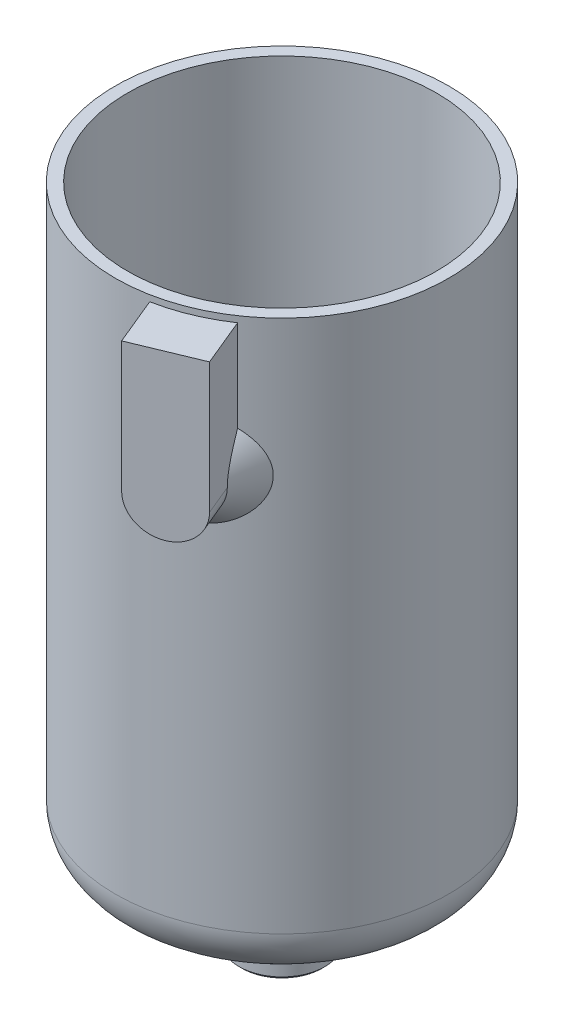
ISO-10303-21;
HEADER;
FILE_DESCRIPTION(('STEP AP214'),'2;1');
FILE_NAME('part.step','',(''),(''),'','','');
FILE_SCHEMA(('AUTOMOTIVE_DESIGN { 1 0 10303 214 1 1 1 1 }'));
ENDSEC;
DATA;
#1=APPLICATION_CONTEXT('core data for automotive mechanical design processes');
#2=APPLICATION_PROTOCOL_DEFINITION('international standard','automotive_design',2000,#1);
#3=PRODUCT_CONTEXT('',#1,'mechanical');
#4=PRODUCT('Part','Part','',(#3));
#5=PRODUCT_RELATED_PRODUCT_CATEGORY('part','',(#4));
#6=PRODUCT_DEFINITION_FORMATION('','',#4);
#7=PRODUCT_DEFINITION_CONTEXT('part definition',#1,'design');
#8=PRODUCT_DEFINITION('design','',#6,#7);
#9=PRODUCT_DEFINITION_SHAPE('','',#8);
#10=(LENGTH_UNIT() NAMED_UNIT(*) SI_UNIT(.MILLI.,.METRE.));
#11=(NAMED_UNIT(*) PLANE_ANGLE_UNIT() SI_UNIT($,.RADIAN.));
#12=(NAMED_UNIT(*) SI_UNIT($,.STERADIAN.) SOLID_ANGLE_UNIT());
#13=UNCERTAINTY_MEASURE_WITH_UNIT(LENGTH_MEASURE(1.E-05),#10,'distance_accuracy_value','');
#14=(GEOMETRIC_REPRESENTATION_CONTEXT(3) GLOBAL_UNCERTAINTY_ASSIGNED_CONTEXT((#13)) GLOBAL_UNIT_ASSIGNED_CONTEXT((#10,
#11,#12)) REPRESENTATION_CONTEXT('',''));
#15=CARTESIAN_POINT('',(0.,0.,0.));
#16=DIRECTION('',(0.,0.,1.));
#17=DIRECTION('',(1.,0.,0.));
#18=AXIS2_PLACEMENT_3D('',#15,#16,#17);
#19=CARTESIAN_POINT('',(0.,0.,0.));
#20=DIRECTION('',(0.,-1.,0.));
#21=DIRECTION('',(0.,0.,-1.));
#22=AXIS2_PLACEMENT_3D('',#19,#20,#21);
#23=CYLINDRICAL_SURFACE('',#22,27.25);
#24=CARTESIAN_POINT('',(0.,0.,0.));
#25=DIRECTION('',(0.,-1.,0.));
#26=DIRECTION('',(0.,0.,-1.));
#27=AXIS2_PLACEMENT_3D('',#24,#25,#26);
#28=CIRCLE('',#27,27.25);
#29=CARTESIAN_POINT('',(0.,0.,-27.25));
#30=VERTEX_POINT('',#29);
#31=EDGE_CURVE('E146',#30,#30,#28,.T.);
#32=ORIENTED_EDGE('',*,*,#31,.T.);
#33=EDGE_LOOP('',(#32));
#34=FACE_BOUND('',#33,.T.);
#35=CARTESIAN_POINT('',(0.,-87.2,0.));
#36=DIRECTION('',(0.,-1.,0.));
#37=DIRECTION('',(0.,0.,-1.));
#38=AXIS2_PLACEMENT_3D('',#35,#36,#37);
#39=CIRCLE('',#38,27.25);
#40=CARTESIAN_POINT('',(0.,-87.2,-27.25));
#41=VERTEX_POINT('',#40);
#42=EDGE_CURVE('E149',#41,#41,#39,.T.);
#43=ORIENTED_EDGE('',*,*,#42,.F.);
#44=EDGE_LOOP('',(#43));
#45=FACE_BOUND('',#44,.T.);
#46=DIRECTION('',(0.,-1.,0.));
#47=VECTOR('',#46,1.);
#48=CARTESIAN_POINT('',(5.13217080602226,0.,26.7623489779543));
#49=LINE('',#48,#47);
#50=CARTESIAN_POINT('',(5.13217080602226,-1.,26.7623489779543));
#51=VERTEX_POINT('',#50);
#52=CARTESIAN_POINT('',(5.13217080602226,-15.9293145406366,26.7623489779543));
#53=VERTEX_POINT('',#52);
#54=EDGE_CURVE('E52',#51,#53,#49,.T.);
#55=ORIENTED_EDGE('',*,*,#54,.F.);
#56=CARTESIAN_POINT('',(0.,-1.,0.));
#57=DIRECTION('',(0.,-1.,0.));
#58=DIRECTION('',(0.,0.,-1.));
#59=AXIS2_PLACEMENT_3D('',#56,#57,#58);
#60=CIRCLE('',#59,27.25);
#61=CARTESIAN_POINT('',(15.2948456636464,-1.,22.5528312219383));
#62=VERTEX_POINT('',#61);
#63=EDGE_CURVE('E11',#62,#51,#60,.T.);
#64=ORIENTED_EDGE('',*,*,#63,.F.);
#65=DIRECTION('',(0.,-1.,0.));
#66=VECTOR('',#65,1.);
#67=CARTESIAN_POINT('',(15.2948456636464,0.,22.5528312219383));
#68=LINE('',#67,#66);
#69=CARTESIAN_POINT('',(15.2948456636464,-15.9293145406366,22.5528312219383));
#70=VERTEX_POINT('',#69);
#71=EDGE_CURVE('E107',#70,#62,#68,.F.);
#72=ORIENTED_EDGE('',*,*,#71,.F.);
#73=CARTESIAN_POINT('',(3.39021248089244,-27.3423893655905,27.0382869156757));
#74=CARTESIAN_POINT('',(3.58895261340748,-27.53196795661,27.0133671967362));
#75=CARTESIAN_POINT('',(3.79571275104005,-27.712737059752,26.9852110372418));
#76=CARTESIAN_POINT('',(4.22272311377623,-28.0563612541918,26.9216965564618));
#77=CARTESIAN_POINT('',(4.44298101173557,-28.2192060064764,26.8863341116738));
#78=CARTESIAN_POINT('',(4.89513629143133,-28.52687842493,26.807702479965));
#79=CARTESIAN_POINT('',(5.12705897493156,-28.6716643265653,26.7644155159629));
#80=CARTESIAN_POINT('',(5.60001691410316,-28.9423832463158,26.6694673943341));
#81=CARTESIAN_POINT('',(5.8410525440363,-29.0683154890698,26.6178058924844));
#82=CARTESIAN_POINT('',(6.33176683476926,-29.3015675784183,26.5053761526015));
#83=CARTESIAN_POINT('',(6.58148878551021,-29.4087708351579,26.4445549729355));
#84=CARTESIAN_POINT('',(7.08628998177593,-29.6031445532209,26.3137791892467));
#85=CARTESIAN_POINT('',(7.34136937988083,-29.6903144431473,26.2438243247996));
#86=CARTESIAN_POINT('',(7.85477618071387,-29.8440752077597,26.094757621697));
#87=CARTESIAN_POINT('',(8.11310058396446,-29.91068381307,26.0156537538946));
#88=CARTESIAN_POINT('',(8.63134056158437,-30.0230071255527,25.8483384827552));
#89=CARTESIAN_POINT('',(8.89125614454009,-30.0687217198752,25.7601270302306));
#90=CARTESIAN_POINT('',(9.41921029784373,-30.1400743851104,25.5718990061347));
#91=CARTESIAN_POINT('',(9.68724021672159,-30.1650166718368,25.4715932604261));
#92=CARTESIAN_POINT('',(10.2209959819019,-30.1921021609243,25.2621443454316));
#93=CARTESIAN_POINT('',(10.4867217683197,-30.1942447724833,25.1530009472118));
#94=CARTESIAN_POINT('',(11.0139427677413,-30.1757119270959,24.9266498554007));
#95=CARTESIAN_POINT('',(11.2754375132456,-30.1550339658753,24.8094412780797));
#96=CARTESIAN_POINT('',(11.7923185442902,-30.0910190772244,24.5679688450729));
#97=CARTESIAN_POINT('',(12.0477049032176,-30.0476824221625,24.4437050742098));
#98=CARTESIAN_POINT('',(12.5474217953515,-29.9393774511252,24.1909508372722));
#99=CARTESIAN_POINT('',(12.7918523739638,-29.8746950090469,24.0625354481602));
#100=CARTESIAN_POINT('',(13.2716072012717,-29.7239955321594,23.8012930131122));
#101=CARTESIAN_POINT('',(13.5069314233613,-29.6379784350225,23.6684659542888));
#102=CARTESIAN_POINT('',(13.9672875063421,-29.4450355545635,23.3997536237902));
#103=CARTESIAN_POINT('',(14.1923116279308,-29.338094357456,23.2638661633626));
#104=CARTESIAN_POINT('',(14.6306370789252,-29.1038631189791,22.9907295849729));
#105=CARTESIAN_POINT('',(14.8439384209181,-28.9765730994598,22.8534804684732));
#106=CARTESIAN_POINT('',(15.261009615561,-28.6999029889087,22.5771492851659));
#107=CARTESIAN_POINT('',(15.4645681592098,-28.550197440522,22.4380736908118));
#108=CARTESIAN_POINT('',(15.8571145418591,-28.230752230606,22.1623993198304));
#109=CARTESIAN_POINT('',(16.0461032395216,-28.0610137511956,22.025800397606));
#110=CARTESIAN_POINT('',(16.4080576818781,-27.7020268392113,21.7575005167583));
#111=CARTESIAN_POINT('',(16.5810364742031,-27.5127945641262,21.6257956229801));
#112=CARTESIAN_POINT('',(16.9095211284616,-27.1152156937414,21.3699315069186));
#113=CARTESIAN_POINT('',(17.0650339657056,-26.9068767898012,21.2457692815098));
#114=CARTESIAN_POINT('',(17.4182638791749,-26.3798438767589,20.9580018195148));
#115=CARTESIAN_POINT('',(17.6062811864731,-26.0515466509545,20.799727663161));
#116=CARTESIAN_POINT('',(17.9366989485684,-25.3601194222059,20.5154821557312));
#117=CARTESIAN_POINT('',(18.0791772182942,-24.9970502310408,20.3894557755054));
#118=CARTESIAN_POINT('',(18.292024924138,-24.3034344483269,20.198550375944));
#119=CARTESIAN_POINT('',(18.3703468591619,-23.9771807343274,20.1270650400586));
#120=CARTESIAN_POINT('',(18.4851144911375,-23.3114724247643,20.0217203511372));
#121=CARTESIAN_POINT('',(18.5215915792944,-22.9720279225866,19.9878327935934));
#122=CARTESIAN_POINT('',(18.5501837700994,-22.2887178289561,19.9613032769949));
#123=CARTESIAN_POINT('',(18.5421825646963,-21.9448429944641,19.9687694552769));
#124=CARTESIAN_POINT('',(18.482148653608,-21.2643164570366,20.0243411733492));
#125=CARTESIAN_POINT('',(18.4300999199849,-20.9276674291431,20.0724615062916));
#126=CARTESIAN_POINT('',(18.2877559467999,-20.2811026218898,20.2022089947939));
#127=CARTESIAN_POINT('',(18.1987189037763,-19.9706785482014,20.2827313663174));
#128=CARTESIAN_POINT('',(17.9869501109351,-19.370256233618,20.4707636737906));
#129=CARTESIAN_POINT('',(17.8641959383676,-19.0802717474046,20.5782915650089));
#130=CARTESIAN_POINT('',(17.526813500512,-18.3974832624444,20.8672500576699));
#131=CARTESIAN_POINT('',(17.2957550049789,-18.0175968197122,21.060094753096));
#132=CARTESIAN_POINT('',(16.7816419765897,-17.3108982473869,21.4720227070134));
#133=CARTESIAN_POINT('',(16.4985033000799,-16.9841736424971,21.6911482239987));
#134=CARTESIAN_POINT('',(15.8832490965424,-16.3814404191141,22.145732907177));
#135=CARTESIAN_POINT('',(15.5504528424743,-16.1062807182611,22.3813901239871));
#136=CARTESIAN_POINT('',(14.8453985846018,-15.6150877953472,22.8551240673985));
#137=CARTESIAN_POINT('',(14.4731513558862,-15.3990384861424,23.0932001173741));
#138=CARTESIAN_POINT('',(13.8595644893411,-15.1067611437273,23.4636819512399));
#139=CARTESIAN_POINT('',(13.6291340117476,-15.009971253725,23.598355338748));
#140=CARTESIAN_POINT('',(13.1583744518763,-14.8375024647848,23.8640444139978));
#141=CARTESIAN_POINT('',(12.9180444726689,-14.7618254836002,23.9950597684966));
#142=CARTESIAN_POINT('',(12.4289190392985,-14.6320780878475,24.2520276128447));
#143=CARTESIAN_POINT('',(12.1801213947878,-14.5780133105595,24.3779787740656));
#144=CARTESIAN_POINT('',(11.6756895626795,-14.4918897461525,24.6235547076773));
#145=CARTESIAN_POINT('',(11.4200555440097,-14.4598304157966,24.7431796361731));
#146=CARTESIAN_POINT('',(10.901455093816,-14.4177803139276,24.9760336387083));
#147=CARTESIAN_POINT('',(10.6384446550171,-14.4079805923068,25.0891992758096));
#148=CARTESIAN_POINT('',(10.1090934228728,-14.411088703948,25.3071266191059));
#149=CARTESIAN_POINT('',(9.84275258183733,-14.4239968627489,25.4118882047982));
#150=CARTESIAN_POINT('',(9.30875605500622,-14.4724153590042,25.612318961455));
#151=CARTESIAN_POINT('',(9.04110057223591,-14.5079223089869,25.7079894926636));
#152=CARTESIAN_POINT('',(8.50645619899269,-14.6012654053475,25.8898132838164));
#153=CARTESIAN_POINT('',(8.23946730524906,-14.6591014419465,25.9759665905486));
#154=CARTESIAN_POINT('',(7.7105597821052,-14.7960844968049,26.1378189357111));
#155=CARTESIAN_POINT('',(7.44861717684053,-14.8750373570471,26.2136041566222));
#156=CARTESIAN_POINT('',(6.92937561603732,-15.0539977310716,26.3556199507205));
#157=CARTESIAN_POINT('',(6.6720766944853,-15.1540053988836,26.4218504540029));
#158=CARTESIAN_POINT('',(6.16387451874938,-15.3746673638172,26.5450104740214));
#159=CARTESIAN_POINT('',(5.91297786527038,-15.4953420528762,26.6019306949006));
#160=CARTESIAN_POINT('',(5.41990459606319,-15.7567595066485,26.7067531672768));
#161=CARTESIAN_POINT('',(5.17772793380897,-15.8975021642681,26.7546554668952));
#162=CARTESIAN_POINT('',(4.70044423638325,-16.2010225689,26.8426553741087));
#163=CARTESIAN_POINT('',(4.46551376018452,-16.3641185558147,26.8826149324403));
#164=CARTESIAN_POINT('',(4.00940706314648,-16.7101168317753,26.9544143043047));
#165=CARTESIAN_POINT('',(3.78822952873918,-16.8930172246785,26.9862548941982));
#166=CARTESIAN_POINT('',(3.36272548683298,-17.2780043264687,27.0425692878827));
#167=CARTESIAN_POINT('',(3.15837608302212,-17.4800641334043,27.0670532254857));
#168=CARTESIAN_POINT('',(2.76964169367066,-17.9030098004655,27.1095893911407));
#169=CARTESIAN_POINT('',(2.5852468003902,-18.1238862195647,27.127644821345));
#170=CARTESIAN_POINT('',(2.18012149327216,-18.6640131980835,27.1636511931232));
#171=CARTESIAN_POINT('',(1.96903151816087,-18.9907764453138,27.1793854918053));
#172=CARTESIAN_POINT('',(1.60164588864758,-19.6742305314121,27.2035186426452));
#173=CARTESIAN_POINT('',(1.44528696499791,-20.0308862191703,27.2119259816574));
#174=CARTESIAN_POINT('',(1.26034920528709,-20.5843484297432,27.2209076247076));
#175=CARTESIAN_POINT('',(1.20681656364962,-20.7729947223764,27.2232995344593));
#176=CARTESIAN_POINT('',(1.11814216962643,-21.1545338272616,27.2270867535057));
#177=CARTESIAN_POINT('',(1.08299080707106,-21.3474243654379,27.2284825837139));
#178=CARTESIAN_POINT('',(1.03209314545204,-21.735659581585,27.2304599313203));
#179=CARTESIAN_POINT('',(1.01633588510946,-21.9310028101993,27.2310419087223));
#180=CARTESIAN_POINT('',(1.00462925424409,-22.3222166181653,27.2314745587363));
#181=CARTESIAN_POINT('',(1.00867729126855,-22.5180871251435,27.2313253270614));
#182=CARTESIAN_POINT('',(1.04649052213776,-23.0475326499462,27.229914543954));
#183=CARTESIAN_POINT('',(1.09935321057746,-23.379910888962,27.2279370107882));
#184=CARTESIAN_POINT('',(1.25871813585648,-24.0313363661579,27.2210253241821));
#185=CARTESIAN_POINT('',(1.36525478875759,-24.3503749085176,27.2160892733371));
#186=CARTESIAN_POINT('',(1.6280697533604,-24.9773821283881,27.2016469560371));
#187=CARTESIAN_POINT('',(1.7856509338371,-25.2847949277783,27.192017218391));
#188=CARTESIAN_POINT('',(2.14083923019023,-25.8748248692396,27.1663554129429));
#189=CARTESIAN_POINT('',(2.33842736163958,-26.1574536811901,27.1503263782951));
#190=CARTESIAN_POINT('',(2.6809858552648,-26.5891390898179,27.1181052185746));
#191=CARTESIAN_POINT('',(2.81571589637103,-26.746689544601,27.1045026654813));
#192=CARTESIAN_POINT('',(3.0955204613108,-27.0519533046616,27.0739735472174));
#193=CARTESIAN_POINT('',(3.24059375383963,-27.1996677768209,27.0570473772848));
#194=CARTESIAN_POINT('',(3.39021248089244,-27.3423893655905,27.0382869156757));
#195=B_SPLINE_CURVE_WITH_KNOTS('',3,(#73,#74,#75,#76,#77,#78,#79,#80,#81,#82,#83,#84,#85,#86,
#87,#88,#89,#90,#91,#92,#93,#94,#95,#96,#97,#98,#99,#100,#101,#102,#103,#104,#105,#106,#107,
#108,#109,#110,#111,#112,#113,#114,#115,#116,#117,#118,#119,#120,#121,#122,#123,#124,#125,#126,
#127,#128,#129,#130,#131,#132,#133,#134,#135,#136,#137,#138,#139,#140,#141,#142,#143,#144,#145,
#146,#147,#148,#149,#150,#151,#152,#153,#154,#155,#156,#157,#158,#159,#160,#161,#162,#163,#164,
#165,#166,#167,#168,#169,#170,#171,#172,#173,#174,#175,#176,#177,#178,#179,#180,#181,#182,#183,
#184,#185,#186,#187,#188,#189,#190,#191,#192,#193,#194),.UNSPECIFIED.,.T.,.F.,(4,2,2,2,2,2,2,2,
2,2,2,2,2,2,2,2,2,2,2,2,2,2,2,2,2,2,2,2,2,2,2,2,2,2,2,2,2,2,2,2,2,2,2,2,2,2,2,2,2,2,2,2,2,2,2,2,
2,2,2,2,4),(0.,0.827146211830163,1.65476706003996,2.48426778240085,3.31380260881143,
4.14833038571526,4.98288196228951,5.81671185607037,6.65054625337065,7.51129970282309,
8.37207545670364,9.23294567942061,10.0938055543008,10.9435749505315,11.7933468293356,
12.6437470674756,13.494146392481,14.358369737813,15.2225421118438,16.0860038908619,
16.9491195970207,18.1746763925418,19.3981276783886,20.4229041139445,21.4469112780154,
22.4735974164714,23.5006573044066,24.4953206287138,25.4906470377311,26.9367776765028,
28.3852656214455,29.8558314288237,31.3259966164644,32.1768697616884,33.0278201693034,
33.8789923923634,34.7301436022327,35.5885729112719,36.4470145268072,37.3053274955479,
38.1636362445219,39.0143095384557,39.8649890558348,40.7165128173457,41.5680320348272,
42.4332586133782,43.298402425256,44.1623489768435,45.0258645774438,46.1894536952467,
47.3516932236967,47.9392502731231,48.5264998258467,49.1134173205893,49.7002579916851,
50.7047089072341,51.7098047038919,52.7428969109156,53.775500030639,54.3982794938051,
55.0209849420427),.UNSPECIFIED.);
#196=EDGE_CURVE('E45',#53,#70,#195,.T.);
#197=ORIENTED_EDGE('',*,*,#196,.F.);
#198=EDGE_LOOP('',(#55,#64,#72,#197));
#199=FACE_BOUND('',#198,.T.);
#200=ADVANCED_FACE('F37',(#34,#45,#199),#23,.T.);
#201=CARTESIAN_POINT('',(9.56708580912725,-22.3,23.0969883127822));
#202=DIRECTION('',(-0.38268343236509,0.,-0.923879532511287));
#203=DIRECTION('',(-0.923879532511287,0.,0.38268343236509));
#204=AXIS2_PLACEMENT_3D('',#201,#202,#203);
#205=CONICAL_SURFACE('',#204,10.,0.753151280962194);
#206=CARTESIAN_POINT('',(4.55072172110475,-14.1396143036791,25.3586067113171));
#207=CARTESIAN_POINT('',(4.59839506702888,-14.2804658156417,25.4737003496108));
#208=CARTESIAN_POINT('',(4.64585664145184,-14.4218098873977,25.5882827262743));
#209=CARTESIAN_POINT('',(4.74028420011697,-14.7056354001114,25.8162510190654));
#210=CARTESIAN_POINT('',(4.78725016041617,-14.8481168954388,25.9296368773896));
#211=CARTESIAN_POINT('',(4.88066483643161,-15.1345245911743,26.1551598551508));
#212=CARTESIAN_POINT('',(4.92711287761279,-15.2784522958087,26.267295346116));
#213=CARTESIAN_POINT('',(5.01933981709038,-15.5677625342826,26.489950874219));
#214=CARTESIAN_POINT('',(5.0651187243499,-15.7131450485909,26.6004709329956));
#215=CARTESIAN_POINT('',(5.15746608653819,-16.010641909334,26.8234171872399));
#216=CARTESIAN_POINT('',(5.20400690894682,-16.1628149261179,26.9357766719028));
#217=CARTESIAN_POINT('',(5.29608963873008,-16.4692099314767,27.1580840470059));
#218=CARTESIAN_POINT('',(5.34163156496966,-16.6234318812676,27.2680319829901));
#219=CARTESIAN_POINT('',(5.43149918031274,-16.9341854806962,27.4849915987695));
#220=CARTESIAN_POINT('',(5.47582535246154,-17.0907161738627,27.5920044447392));
#221=CARTESIAN_POINT('',(5.56302222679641,-17.4065144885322,27.802516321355));
#222=CARTESIAN_POINT('',(5.60589300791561,-17.565781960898,27.9060155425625));
#223=CARTESIAN_POINT('',(5.69895588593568,-17.9223582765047,28.130689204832));
#224=CARTESIAN_POINT('',(5.74872156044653,-18.1204322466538,28.2508341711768));
#225=CARTESIAN_POINT('',(5.84485032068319,-18.5222228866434,28.4829095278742));
#226=CARTESIAN_POINT('',(5.89121293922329,-18.7259403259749,28.5948387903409));
#227=CARTESIAN_POINT('',(5.97883802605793,-19.1370769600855,28.8063844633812));
#228=CARTESIAN_POINT('',(6.02016258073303,-19.3444049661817,28.9061507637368));
#229=CARTESIAN_POINT('',(6.09705797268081,-19.7663041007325,29.0917926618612));
#230=CARTESIAN_POINT('',(6.13263004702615,-19.9808736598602,29.1776712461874));
#231=CARTESIAN_POINT('',(6.18861007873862,-20.3652278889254,29.3128189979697));
#232=CARTESIAN_POINT('',(6.2106091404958,-20.5334221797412,29.3659294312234));
#233=CARTESIAN_POINT('',(6.24933901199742,-20.8738542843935,29.4594316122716));
#234=CARTESIAN_POINT('',(6.26607398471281,-21.0460887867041,29.499833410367));
#235=CARTESIAN_POINT('',(6.28672511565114,-21.3086097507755,29.5496896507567));
#236=CARTESIAN_POINT('',(6.29290472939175,-21.3977046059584,29.5646085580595));
#237=CARTESIAN_POINT('',(6.30357992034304,-21.5765844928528,29.590380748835));
#238=CARTESIAN_POINT('',(6.30807558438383,-21.6663694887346,29.6012342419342));
#239=CARTESIAN_POINT('',(6.31531454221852,-21.8466902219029,29.6187106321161));
#240=CARTESIAN_POINT('',(6.31805262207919,-21.9372273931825,29.6253209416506));
#241=CARTESIAN_POINT('',(6.32171354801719,-22.1185744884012,29.634159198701));
#242=CARTESIAN_POINT('',(6.32263592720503,-22.209384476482,29.6363860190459));
#243=CARTESIAN_POINT('',(6.32262885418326,-22.3002,29.6363689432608));
#244=B_SPLINE_CURVE_WITH_KNOTS('',3,(#206,#207,#208,#209,#210,#211,#212,#213,#214,#215,#216,
#217,#218,#219,#220,#221,#222,#223,#224,#225,#226,#227,#228,#229,#230,#231,#232,#233,#234,#235,
#236,#237,#238,#239,#240,#241,#242,#243),.UNSPECIFIED.,.F.,.F.,(4,2,2,2,2,2,2,2,2,2,2,2,2,2,2,2,
2,2,4),(0.,0.564117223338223,1.12826157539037,1.69307053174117,2.25787191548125,
2.84225010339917,3.42661724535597,4.01074873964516,4.59484850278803,5.30551164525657,
6.01627216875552,6.71712475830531,7.41782642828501,7.95060623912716,8.48296364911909,
8.75451103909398,9.02604442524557,9.29837964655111,9.57078488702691),.UNSPECIFIED.);
#245=CARTESIAN_POINT('',(6.32262885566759,-22.3,29.6363689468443));
#246=VERTEX_POINT('',#245);
#247=EDGE_CURVE('E137',#53,#246,#244,.T.);
#248=ORIENTED_EDGE('',*,*,#247,.F.);
#249=ORIENTED_EDGE('',*,*,#196,.T.);
#250=CARTESIAN_POINT('',(16.4853037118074,-22.3002,25.4268511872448));
#251=CARTESIAN_POINT('',(16.4853061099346,-22.2304520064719,25.426856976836));
#252=CARTESIAN_POINT('',(16.4847639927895,-22.1607118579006,25.4255481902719));
#253=CARTESIAN_POINT('',(16.4826037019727,-22.0213519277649,25.4203327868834));
#254=CARTESIAN_POINT('',(16.4809856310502,-21.9517321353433,25.4164264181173));
#255=CARTESIAN_POINT('',(16.474543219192,-21.7433982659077,25.4008730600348));
#256=CARTESIAN_POINT('',(16.4681306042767,-21.605000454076,25.385391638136));
#257=CARTESIAN_POINT('',(16.4514607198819,-21.3321183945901,25.3451469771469));
#258=CARTESIAN_POINT('',(16.4412671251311,-21.1976070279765,25.3205374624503));
#259=CARTESIAN_POINT('',(16.4173821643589,-20.9306948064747,25.2628740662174));
#260=CARTESIAN_POINT('',(16.4036895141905,-20.7982947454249,25.2298170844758));
#261=CARTESIAN_POINT('',(16.361086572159,-20.4315867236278,25.1269644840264));
#262=CARTESIAN_POINT('',(16.3287355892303,-20.1999957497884,25.0488623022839));
#263=CARTESIAN_POINT('',(16.2563843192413,-19.7451184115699,24.8741908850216));
#264=CARTESIAN_POINT('',(16.2163770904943,-19.5218398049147,24.7776048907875));
#265=CARTESIAN_POINT('',(16.1299238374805,-19.079275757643,24.5688882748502));
#266=CARTESIAN_POINT('',(16.0833802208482,-18.8601220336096,24.4565220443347));
#267=CARTESIAN_POINT('',(15.985910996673,-18.4287514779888,24.2212105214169));
#268=CARTESIAN_POINT('',(15.934986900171,-18.2165322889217,24.0982688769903));
#269=CARTESIAN_POINT('',(15.8382886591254,-17.8315306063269,23.8648186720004));
#270=CARTESIAN_POINT('',(15.7930052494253,-17.6578994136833,23.7554948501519));
#271=CARTESIAN_POINT('',(15.7005661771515,-17.3140628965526,23.5323271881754));
#272=CARTESIAN_POINT('',(15.6534103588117,-17.1438578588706,23.4184829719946));
#273=CARTESIAN_POINT('',(15.5575602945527,-16.8062775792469,23.187080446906));
#274=CARTESIAN_POINT('',(15.5088651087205,-16.6389041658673,23.0695198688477));
#275=CARTESIAN_POINT('',(15.4102382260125,-16.3066622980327,22.8314135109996));
#276=CARTESIAN_POINT('',(15.3603064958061,-16.1417939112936,22.7108676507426));
#277=CARTESIAN_POINT('',(15.2616297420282,-15.821377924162,22.4726408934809));
#278=CARTESIAN_POINT('',(15.2129284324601,-15.665738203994,22.3550655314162));
#279=CARTESIAN_POINT('',(15.1147384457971,-15.3561615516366,22.1180139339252));
#280=CARTESIAN_POINT('',(15.0652497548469,-15.2022246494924,21.9985376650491));
#281=CARTESIAN_POINT('',(14.9656909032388,-14.8960968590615,21.7581813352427));
#282=CARTESIAN_POINT('',(14.9156218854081,-14.7439034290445,21.637304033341));
#283=CARTESIAN_POINT('',(14.8149142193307,-14.4408249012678,21.394174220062));
#284=CARTESIAN_POINT('',(14.764275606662,-14.2899397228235,21.2719217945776));
#285=CARTESIAN_POINT('',(14.7133965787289,-14.1396143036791,21.1490889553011));
#286=B_SPLINE_CURVE_WITH_KNOTS('',3,(#250,#251,#252,#253,#254,#255,#256,#257,#258,#259,#260,
#261,#262,#263,#264,#265,#266,#267,#268,#269,#270,#271,#272,#273,#274,#275,#276,#277,#278,#279,
#280,#281,#282,#283,#284,#285),.UNSPECIFIED.,.F.,.F.,(4,2,2,2,2,2,2,2,2,2,2,2,2,2,2,2,2,4),(0.,
0.209214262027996,0.418408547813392,0.836171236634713,1.24719623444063,1.65837229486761,
2.39663619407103,3.13557265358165,3.88702666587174,4.63822249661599,5.26848424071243,
5.89879852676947,6.52950540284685,7.16022929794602,7.7633471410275,8.36647560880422,
8.96856967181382,9.57062633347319),.UNSPECIFIED.);
#287=CARTESIAN_POINT('',(16.4853037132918,-22.3,25.4268511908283));
#288=VERTEX_POINT('',#287);
#289=EDGE_CURVE('E104',#288,#70,#286,.T.);
#290=ORIENTED_EDGE('',*,*,#289,.F.);
#291=CARTESIAN_POINT('',(11.4039662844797,-22.3,27.5316100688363));
#292=DIRECTION('',(0.38268343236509,0.,0.923879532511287));
#293=DIRECTION('',(0.923879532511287,0.,-0.38268343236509));
#294=AXIS2_PLACEMENT_3D('',#291,#292,#293);
#295=CIRCLE('',#294,5.50000000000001);
#296=EDGE_CURVE('E143',#246,#288,#295,.T.);
#297=ORIENTED_EDGE('',*,*,#296,.F.);
#298=EDGE_LOOP('',(#248,#249,#290,#297));
#299=FACE_BOUND('',#298,.T.);
#300=ADVANCED_FACE('F119',(#299),#205,.T.);
#301=CARTESIAN_POINT('',(0.,-92.1,0.));
#302=DIRECTION('',(0.,1.,0.));
#303=DIRECTION('',(0.,0.,1.));
#304=AXIS2_PLACEMENT_3D('',#301,#302,#303);
#305=PLANE('',#304);
#306=CARTESIAN_POINT('',(0.,-92.1,0.));
#307=DIRECTION('',(0.,-1.,0.));
#308=DIRECTION('',(0.,0.,-1.));
#309=AXIS2_PLACEMENT_3D('',#306,#307,#308);
#310=CIRCLE('',#309,5.);
#311=CARTESIAN_POINT('',(0.,-92.1,-5.));
#312=VERTEX_POINT('',#311);
#313=EDGE_CURVE('E191',#312,#312,#310,.T.);
#314=ORIENTED_EDGE('',*,*,#313,.T.);
#315=EDGE_LOOP('',(#314));
#316=FACE_BOUND('',#315,.T.);
#317=ADVANCED_FACE('F39',(#316),#305,.F.);
#318=CARTESIAN_POINT('',(0.,0.,0.));
#319=DIRECTION('',(0.,-1.,0.));
#320=DIRECTION('',(0.,0.,-1.));
#321=AXIS2_PLACEMENT_3D('',#318,#319,#320);
#322=CYLINDRICAL_SURFACE('',#321,5.);
#323=ORIENTED_EDGE('',*,*,#313,.F.);
#324=EDGE_LOOP('',(#323));
#325=FACE_BOUND('',#324,.T.);
#326=CARTESIAN_POINT('',(0.,-108.1,0.));
#327=DIRECTION('',(0.,-1.,0.));
#328=DIRECTION('',(0.,0.,-1.));
#329=AXIS2_PLACEMENT_3D('',#326,#327,#328);
#330=CIRCLE('',#329,5.);
#331=CARTESIAN_POINT('',(0.,-108.1,-5.));
#332=VERTEX_POINT('',#331);
#333=EDGE_CURVE('E188',#332,#332,#330,.T.);
#334=ORIENTED_EDGE('',*,*,#333,.T.);
#335=EDGE_LOOP('',(#334));
#336=FACE_BOUND('',#335,.T.);
#337=ADVANCED_FACE('F251',(#325,#336),#322,.F.);
#338=CARTESIAN_POINT('',(-5.,-108.1,0.));
#339=DIRECTION('',(0.,1.,0.));
#340=DIRECTION('',(0.,0.,1.));
#341=AXIS2_PLACEMENT_3D('',#338,#339,#340);
#342=PLANE('',#341);
#343=ORIENTED_EDGE('',*,*,#333,.F.);
#344=EDGE_LOOP('',(#343));
#345=FACE_BOUND('',#344,.T.);
#346=CARTESIAN_POINT('',(0.,-108.1,0.));
#347=DIRECTION('',(0.,-1.,0.));
#348=DIRECTION('',(0.,0.,-1.));
#349=AXIS2_PLACEMENT_3D('',#346,#347,#348);
#350=CIRCLE('',#349,6.5);
#351=CARTESIAN_POINT('',(0.,-108.1,-6.5));
#352=VERTEX_POINT('',#351);
#353=EDGE_CURVE('E185',#352,#352,#350,.T.);
#354=ORIENTED_EDGE('',*,*,#353,.T.);
#355=EDGE_LOOP('',(#354));
#356=FACE_BOUND('',#355,.T.);
#357=ADVANCED_FACE('F248',(#345,#356),#342,.F.);
#358=CARTESIAN_POINT('',(0.,-107.6,0.));
#359=DIRECTION('',(0.,1.,0.));
#360=DIRECTION('',(0.,0.,1.));
#361=AXIS2_PLACEMENT_3D('',#358,#359,#360);
#362=CONICAL_SURFACE('',#361,7.,0.785398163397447);
#363=ORIENTED_EDGE('',*,*,#353,.F.);
#364=EDGE_LOOP('',(#363));
#365=FACE_BOUND('',#364,.T.);
#366=CARTESIAN_POINT('',(0.,-107.6,0.));
#367=DIRECTION('',(0.,-1.,0.));
#368=DIRECTION('',(0.,0.,-1.));
#369=AXIS2_PLACEMENT_3D('',#366,#367,#368);
#370=CIRCLE('',#369,7.);
#371=CARTESIAN_POINT('',(0.,-107.6,-7.));
#372=VERTEX_POINT('',#371);
#373=EDGE_CURVE('E182',#372,#372,#370,.T.);
#374=ORIENTED_EDGE('',*,*,#373,.T.);
#375=EDGE_LOOP('',(#374));
#376=FACE_BOUND('',#375,.T.);
#377=ADVANCED_FACE('F244',(#365,#376),#362,.T.);
#378=CARTESIAN_POINT('',(0.,0.,0.));
#379=DIRECTION('',(0.,-1.,0.));
#380=DIRECTION('',(0.,0.,-1.));
#381=AXIS2_PLACEMENT_3D('',#378,#379,#380);
#382=CYLINDRICAL_SURFACE('',#381,7.);
#383=ORIENTED_EDGE('',*,*,#373,.F.);
#384=EDGE_LOOP('',(#383));
#385=FACE_BOUND('',#384,.T.);
#386=CARTESIAN_POINT('',(0.,-102.1,0.));
#387=DIRECTION('',(0.,-1.,0.));
#388=DIRECTION('',(0.,0.,-1.));
#389=AXIS2_PLACEMENT_3D('',#386,#387,#388);
#390=CIRCLE('',#389,7.);
#391=CARTESIAN_POINT('',(0.,-102.1,-7.));
#392=VERTEX_POINT('',#391);
#393=EDGE_CURVE('E179',#392,#392,#390,.T.);
#394=ORIENTED_EDGE('',*,*,#393,.T.);
#395=EDGE_LOOP('',(#394));
#396=FACE_BOUND('',#395,.T.);
#397=ADVANCED_FACE('F240',(#385,#396),#382,.T.);
#398=CARTESIAN_POINT('',(0.,-101.35,0.));
#399=DIRECTION('',(0.,1.,0.));
#400=DIRECTION('',(0.,0.,1.));
#401=AXIS2_PLACEMENT_3D('',#398,#399,#400);
#402=CONICAL_SURFACE('',#401,7.75,0.785398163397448);
#403=ORIENTED_EDGE('',*,*,#393,.F.);
#404=EDGE_LOOP('',(#403));
#405=FACE_BOUND('',#404,.T.);
#406=CARTESIAN_POINT('',(0.,-101.35,0.));
#407=DIRECTION('',(0.,-1.,0.));
#408=DIRECTION('',(0.,0.,-1.));
#409=AXIS2_PLACEMENT_3D('',#406,#407,#408);
#410=CIRCLE('',#409,7.75);
#411=CARTESIAN_POINT('',(0.,-101.35,-7.75));
#412=VERTEX_POINT('',#411);
#413=EDGE_CURVE('E176',#412,#412,#410,.T.);
#414=ORIENTED_EDGE('',*,*,#413,.T.);
#415=EDGE_LOOP('',(#414));
#416=FACE_BOUND('',#415,.T.);
#417=ADVANCED_FACE('F236',(#405,#416),#402,.T.);
#418=CARTESIAN_POINT('',(0.,0.,0.));
#419=DIRECTION('',(0.,-1.,0.));
#420=DIRECTION('',(0.,0.,-1.));
#421=AXIS2_PLACEMENT_3D('',#418,#419,#420);
#422=CYLINDRICAL_SURFACE('',#421,7.75);
#423=ORIENTED_EDGE('',*,*,#413,.F.);
#424=EDGE_LOOP('',(#423));
#425=FACE_BOUND('',#424,.T.);
#426=CARTESIAN_POINT('',(0.,-96.9,0.));
#427=DIRECTION('',(0.,-1.,0.));
#428=DIRECTION('',(0.,0.,-1.));
#429=AXIS2_PLACEMENT_3D('',#426,#427,#428);
#430=CIRCLE('',#429,7.75);
#431=CARTESIAN_POINT('',(0.,-96.9,-7.75));
#432=VERTEX_POINT('',#431);
#433=EDGE_CURVE('E173',#432,#432,#430,.T.);
#434=ORIENTED_EDGE('',*,*,#433,.T.);
#435=EDGE_LOOP('',(#434));
#436=FACE_BOUND('',#435,.T.);
#437=ADVANCED_FACE('F232',(#425,#436),#422,.T.);
#438=CARTESIAN_POINT('',(-7.75,-96.9,0.));
#439=DIRECTION('',(0.,1.,0.));
#440=DIRECTION('',(0.,0.,1.));
#441=AXIS2_PLACEMENT_3D('',#438,#439,#440);
#442=PLANE('',#441);
#443=ORIENTED_EDGE('',*,*,#433,.F.);
#444=EDGE_LOOP('',(#443));
#445=FACE_BOUND('',#444,.T.);
#446=CARTESIAN_POINT('',(0.,-96.9,0.));
#447=DIRECTION('',(0.,-1.,0.));
#448=DIRECTION('',(0.,0.,-1.));
#449=AXIS2_PLACEMENT_3D('',#446,#447,#448);
#450=CIRCLE('',#449,10.3);
#451=CARTESIAN_POINT('',(0.,-96.9,-10.3));
#452=VERTEX_POINT('',#451);
#453=EDGE_CURVE('E170',#452,#452,#450,.T.);
#454=ORIENTED_EDGE('',*,*,#453,.T.);
#455=EDGE_LOOP('',(#454));
#456=FACE_BOUND('',#455,.T.);
#457=ADVANCED_FACE('F228',(#445,#456),#442,.F.);
#458=CARTESIAN_POINT('',(0.,-96.4,0.));
#459=DIRECTION('',(0.,1.,0.));
#460=DIRECTION('',(0.,0.,1.));
#461=AXIS2_PLACEMENT_3D('',#458,#459,#460);
#462=CONICAL_SURFACE('',#461,10.8,0.785398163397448);
#463=ORIENTED_EDGE('',*,*,#453,.F.);
#464=EDGE_LOOP('',(#463));
#465=FACE_BOUND('',#464,.T.);
#466=CARTESIAN_POINT('',(0.,-96.4,0.));
#467=DIRECTION('',(0.,-1.,0.));
#468=DIRECTION('',(0.,0.,-1.));
#469=AXIS2_PLACEMENT_3D('',#466,#467,#468);
#470=CIRCLE('',#469,10.8);
#471=CARTESIAN_POINT('',(0.,-96.4,-10.8));
#472=VERTEX_POINT('',#471);
#473=EDGE_CURVE('E167',#472,#472,#470,.T.);
#474=ORIENTED_EDGE('',*,*,#473,.T.);
#475=EDGE_LOOP('',(#474));
#476=FACE_BOUND('',#475,.T.);
#477=ADVANCED_FACE('F224',(#465,#476),#462,.T.);
#478=CARTESIAN_POINT('',(0.,0.,0.));
#479=DIRECTION('',(0.,-1.,0.));
#480=DIRECTION('',(0.,0.,-1.));
#481=AXIS2_PLACEMENT_3D('',#478,#479,#480);
#482=CYLINDRICAL_SURFACE('',#481,10.8);
#483=ORIENTED_EDGE('',*,*,#473,.F.);
#484=EDGE_LOOP('',(#483));
#485=FACE_BOUND('',#484,.T.);
#486=CARTESIAN_POINT('',(0.,-87.9464274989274,0.));
#487=DIRECTION('',(0.,-1.,0.));
#488=DIRECTION('',(0.,0.,-1.));
#489=AXIS2_PLACEMENT_3D('',#486,#487,#488);
#490=CIRCLE('',#489,10.8);
#491=CARTESIAN_POINT('',(0.,-87.9464274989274,-10.8));
#492=VERTEX_POINT('',#491);
#493=EDGE_CURVE('E164',#492,#492,#490,.T.);
#494=ORIENTED_EDGE('',*,*,#493,.T.);
#495=EDGE_LOOP('',(#494));
#496=FACE_BOUND('',#495,.T.);
#497=ADVANCED_FACE('F220',(#485,#496),#482,.T.);
#498=CARTESIAN_POINT('',(0.,-81.9999999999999,0.));
#499=DIRECTION('',(0.,-1.,0.));
#500=DIRECTION('',(0.,0.,-1.));
#501=AXIS2_PLACEMENT_3D('',#498,#499,#500);
#502=TOROIDAL_SURFACE('',#501,9.99999999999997,6.00000000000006);
#503=ORIENTED_EDGE('',*,*,#493,.F.);
#504=EDGE_LOOP('',(#503));
#505=FACE_BOUND('',#504,.T.);
#506=CARTESIAN_POINT('',(0.,-85.,0.));
#507=DIRECTION('',(0.,-1.,0.));
#508=DIRECTION('',(0.,0.,-1.));
#509=AXIS2_PLACEMENT_3D('',#506,#507,#508);
#510=CIRCLE('',#509,15.1961524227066);
#511=CARTESIAN_POINT('',(0.,-85.,-15.1961524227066));
#512=VERTEX_POINT('',#511);
#513=EDGE_CURVE('E161',#512,#512,#510,.T.);
#514=ORIENTED_EDGE('',*,*,#513,.T.);
#515=EDGE_LOOP('',(#514));
#516=FACE_BOUND('',#515,.T.);
#517=ADVANCED_FACE('F216',(#505,#516),#502,.T.);
#518=CARTESIAN_POINT('',(-15.1961524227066,-85.,0.));
#519=DIRECTION('',(0.,1.,0.));
#520=DIRECTION('',(0.,0.,1.));
#521=AXIS2_PLACEMENT_3D('',#518,#519,#520);
#522=PLANE('',#521);
#523=ORIENTED_EDGE('',*,*,#513,.F.);
#524=EDGE_LOOP('',(#523));
#525=FACE_BOUND('',#524,.T.);
#526=CARTESIAN_POINT('',(0.,-85.,0.));
#527=DIRECTION('',(0.,-1.,0.));
#528=DIRECTION('',(0.,0.,-1.));
#529=AXIS2_PLACEMENT_3D('',#526,#527,#528);
#530=CIRCLE('',#529,16.);
#531=CARTESIAN_POINT('',(0.,-85.,-16.));
#532=VERTEX_POINT('',#531);
#533=EDGE_CURVE('E158',#532,#532,#530,.T.);
#534=ORIENTED_EDGE('',*,*,#533,.T.);
#535=EDGE_LOOP('',(#534));
#536=FACE_BOUND('',#535,.T.);
#537=ADVANCED_FACE('F212',(#525,#536),#522,.F.);
#538=CARTESIAN_POINT('',(0.,0.,0.));
#539=DIRECTION('',(0.,-1.,0.));
#540=DIRECTION('',(0.,0.,-1.));
#541=AXIS2_PLACEMENT_3D('',#538,#539,#540);
#542=CYLINDRICAL_SURFACE('',#541,16.);
#543=ORIENTED_EDGE('',*,*,#533,.F.);
#544=EDGE_LOOP('',(#543));
#545=FACE_BOUND('',#544,.T.);
#546=CARTESIAN_POINT('',(0.,-95.4,0.));
#547=DIRECTION('',(0.,-1.,0.));
#548=DIRECTION('',(0.,0.,-1.));
#549=AXIS2_PLACEMENT_3D('',#546,#547,#548);
#550=CIRCLE('',#549,16.);
#551=CARTESIAN_POINT('',(0.,-95.4,-16.));
#552=VERTEX_POINT('',#551);
#553=EDGE_CURVE('E155',#552,#552,#550,.T.);
#554=ORIENTED_EDGE('',*,*,#553,.T.);
#555=EDGE_LOOP('',(#554));
#556=FACE_BOUND('',#555,.T.);
#557=ADVANCED_FACE('F208',(#545,#556),#542,.F.);
#558=CARTESIAN_POINT('',(-16.,-95.4,0.));
#559=DIRECTION('',(0.,1.,0.));
#560=DIRECTION('',(0.,0.,1.));
#561=AXIS2_PLACEMENT_3D('',#558,#559,#560);
#562=PLANE('',#561);
#563=ORIENTED_EDGE('',*,*,#553,.F.);
#564=EDGE_LOOP('',(#563));
#565=FACE_BOUND('',#564,.T.);
#566=CARTESIAN_POINT('',(0.,-95.4,0.));
#567=DIRECTION('',(0.,-1.,0.));
#568=DIRECTION('',(0.,0.,-1.));
#569=AXIS2_PLACEMENT_3D('',#566,#567,#568);
#570=CIRCLE('',#569,19.05);
#571=CARTESIAN_POINT('',(0.,-95.4,-19.05));
#572=VERTEX_POINT('',#571);
#573=EDGE_CURVE('E152',#572,#572,#570,.T.);
#574=ORIENTED_EDGE('',*,*,#573,.T.);
#575=EDGE_LOOP('',(#574));
#576=FACE_BOUND('',#575,.T.);
#577=ADVANCED_FACE('F204',(#565,#576),#562,.F.);
#578=CARTESIAN_POINT('',(0.,-87.2,0.));
#579=DIRECTION('',(0.,-1.,0.));
#580=DIRECTION('',(0.,0.,-1.));
#581=AXIS2_PLACEMENT_3D('',#578,#579,#580);
#582=TOROIDAL_SURFACE('',#581,19.05,8.20000000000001);
#583=ORIENTED_EDGE('',*,*,#573,.F.);
#584=EDGE_LOOP('',(#583));
#585=FACE_BOUND('',#584,.T.);
#586=ORIENTED_EDGE('',*,*,#42,.T.);
#587=EDGE_LOOP('',(#586));
#588=FACE_BOUND('',#587,.T.);
#589=ADVANCED_FACE('F201',(#585,#588),#582,.T.);
#590=CARTESIAN_POINT('',(-27.25,0.,0.));
#591=DIRECTION('',(0.,-1.,0.));
#592=DIRECTION('',(0.,0.,-1.));
#593=AXIS2_PLACEMENT_3D('',#590,#591,#592);
#594=PLANE('',#593);
#595=CARTESIAN_POINT('',(0.,0.,0.));
#596=DIRECTION('',(0.,-1.,0.));
#597=DIRECTION('',(0.,0.,-1.));
#598=AXIS2_PLACEMENT_3D('',#595,#596,#597);
#599=CIRCLE('',#598,25.25);
#600=CARTESIAN_POINT('',(0.,0.,-25.25));
#601=VERTEX_POINT('',#600);
#602=EDGE_CURVE('E309',#601,#601,#599,.T.);
#603=ORIENTED_EDGE('',*,*,#602,.T.);
#604=EDGE_LOOP('',(#603));
#605=FACE_BOUND('',#604,.T.);
#606=ORIENTED_EDGE('',*,*,#31,.F.);
#607=EDGE_LOOP('',(#606));
#608=FACE_BOUND('',#607,.T.);
#609=ADVANCED_FACE('F136',(#605,#608),#594,.F.);
#610=CARTESIAN_POINT('',(8.37763888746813,-1.,34.5976020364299));
#611=DIRECTION('',(0.923879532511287,0.,-0.38268343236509));
#612=DIRECTION('',(-0.38268343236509,0.,-0.923879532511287));
#613=AXIS2_PLACEMENT_3D('',#610,#611,#612);
#614=PLANE('',#613);
#615=DIRECTION('',(-0.38268343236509,0.,-0.923879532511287));
#616=VECTOR('',#615,1.);
#617=CARTESIAN_POINT('',(8.37763888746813,-1.,34.5976020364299));
#618=LINE('',#617,#616);
#619=CARTESIAN_POINT('',(8.37763888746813,-1.,34.5976020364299));
#620=VERTEX_POINT('',#619);
#621=EDGE_CURVE('E85',#620,#51,#618,.T.);
#622=ORIENTED_EDGE('',*,*,#621,.T.);
#623=ORIENTED_EDGE('',*,*,#54,.T.);
#624=ORIENTED_EDGE('',*,*,#247,.T.);
#625=DIRECTION('',(-0.38268343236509,0.,-0.923879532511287));
#626=VECTOR('',#625,1.);
#627=CARTESIAN_POINT('',(8.37763888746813,-22.3,34.5976020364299));
#628=LINE('',#627,#626);
#629=CARTESIAN_POINT('',(8.37763888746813,-22.3,34.5976020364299));
#630=VERTEX_POINT('',#629);
#631=EDGE_CURVE('E88',#630,#246,#628,.T.);
#632=ORIENTED_EDGE('',*,*,#631,.F.);
#633=DIRECTION('',(0.,-1.,0.));
#634=VECTOR('',#633,1.);
#635=CARTESIAN_POINT('',(8.37763888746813,-1.,34.5976020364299));
#636=LINE('',#635,#634);
#637=EDGE_CURVE('E81',#620,#630,#636,.T.);
#638=ORIENTED_EDGE('',*,*,#637,.F.);
#639=EDGE_LOOP('',(#622,#623,#624,#632,#638));
#640=FACE_BOUND('',#639,.T.);
#641=ADVANCED_FACE('F83',(#640),#614,.F.);
#642=CARTESIAN_POINT('',(13.4589763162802,-22.3,32.492843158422));
#643=DIRECTION('',(-0.38268343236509,0.,-0.923879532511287));
#644=DIRECTION('',(-0.923879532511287,0.,0.38268343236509));
#645=AXIS2_PLACEMENT_3D('',#642,#643,#644);
#646=CYLINDRICAL_SURFACE('',#645,5.5);
#647=ORIENTED_EDGE('',*,*,#631,.T.);
#648=ORIENTED_EDGE('',*,*,#296,.T.);
#649=DIRECTION('',(-0.38268343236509,0.,-0.923879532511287));
#650=VECTOR('',#649,1.);
#651=CARTESIAN_POINT('',(18.5403137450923,-22.3,30.388084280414));
#652=LINE('',#651,#650);
#653=CARTESIAN_POINT('',(18.5403137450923,-22.3,30.388084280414));
#654=VERTEX_POINT('',#653);
#655=EDGE_CURVE('E109',#654,#288,#652,.T.);
#656=ORIENTED_EDGE('',*,*,#655,.F.);
#657=CARTESIAN_POINT('',(13.4589763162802,-22.3,32.492843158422));
#658=DIRECTION('',(0.38268343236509,0.,0.923879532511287));
#659=DIRECTION('',(0.923879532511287,0.,-0.38268343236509));
#660=AXIS2_PLACEMENT_3D('',#657,#658,#659);
#661=CIRCLE('',#660,5.5);
#662=EDGE_CURVE('E91',#630,#654,#661,.T.);
#663=ORIENTED_EDGE('',*,*,#662,.F.);
#664=EDGE_LOOP('',(#647,#648,#656,#663));
#665=FACE_BOUND('',#664,.T.);
#666=ADVANCED_FACE('F128',(#665),#646,.T.);
#667=CARTESIAN_POINT('',(18.5403137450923,-22.3,30.388084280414));
#668=DIRECTION('',(-0.923879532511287,0.,0.38268343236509));
#669=DIRECTION('',(0.38268343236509,0.,0.923879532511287));
#670=AXIS2_PLACEMENT_3D('',#667,#668,#669);
#671=PLANE('',#670);
#672=ORIENTED_EDGE('',*,*,#289,.T.);
#673=ORIENTED_EDGE('',*,*,#71,.T.);
#674=DIRECTION('',(-0.38268343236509,0.,-0.923879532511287));
#675=VECTOR('',#674,1.);
#676=CARTESIAN_POINT('',(18.5403137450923,-1.,30.388084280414));
#677=LINE('',#676,#675);
#678=CARTESIAN_POINT('',(18.5403137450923,-1.,30.388084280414));
#679=VERTEX_POINT('',#678);
#680=EDGE_CURVE('E295',#679,#62,#677,.T.);
#681=ORIENTED_EDGE('',*,*,#680,.F.);
#682=DIRECTION('',(0.,1.,0.));
#683=VECTOR('',#682,1.);
#684=CARTESIAN_POINT('',(18.5403137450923,-22.3,30.388084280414));
#685=LINE('',#684,#683);
#686=EDGE_CURVE('E97',#654,#679,#685,.T.);
#687=ORIENTED_EDGE('',*,*,#686,.F.);
#688=ORIENTED_EDGE('',*,*,#655,.T.);
#689=EDGE_LOOP('',(#672,#673,#681,#687,#688));
#690=FACE_BOUND('',#689,.T.);
#691=ADVANCED_FACE('F123',(#690),#671,.F.);
#692=CARTESIAN_POINT('',(18.5403137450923,-1.,30.388084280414));
#693=DIRECTION('',(0.,-1.,0.));
#694=DIRECTION('',(0.,0.,-1.));
#695=AXIS2_PLACEMENT_3D('',#692,#693,#694);
#696=PLANE('',#695);
#697=ORIENTED_EDGE('',*,*,#680,.T.);
#698=ORIENTED_EDGE('',*,*,#63,.T.);
#699=ORIENTED_EDGE('',*,*,#621,.F.);
#700=DIRECTION('',(-0.923879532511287,0.,0.38268343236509));
#701=VECTOR('',#700,1.);
#702=CARTESIAN_POINT('',(18.5403137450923,-1.,30.388084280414));
#703=LINE('',#702,#701);
#704=EDGE_CURVE('E92',#679,#620,#703,.T.);
#705=ORIENTED_EDGE('',*,*,#704,.F.);
#706=EDGE_LOOP('',(#697,#698,#699,#705));
#707=FACE_BOUND('',#706,.T.);
#708=ADVANCED_FACE('F103',(#707),#696,.F.);
#709=CARTESIAN_POINT('',(13.4589763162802,-22.3,32.492843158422));
#710=DIRECTION('',(0.38268343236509,0.,0.923879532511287));
#711=DIRECTION('',(0.923879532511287,0.,-0.38268343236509));
#712=AXIS2_PLACEMENT_3D('',#709,#710,#711);
#713=PLANE('',#712);
#714=ORIENTED_EDGE('',*,*,#704,.T.);
#715=ORIENTED_EDGE('',*,*,#637,.T.);
#716=ORIENTED_EDGE('',*,*,#662,.T.);
#717=ORIENTED_EDGE('',*,*,#686,.T.);
#718=EDGE_LOOP('',(#714,#715,#716,#717));
#719=FACE_BOUND('',#718,.T.);
#720=ADVANCED_FACE('F95',(#719),#713,.T.);
#721=CARTESIAN_POINT('',(0.,-83.,0.));
#722=DIRECTION('',(0.,1.,0.));
#723=DIRECTION('',(0.,0.,1.));
#724=AXIS2_PLACEMENT_3D('',#721,#722,#723);
#725=PLANE('',#724);
#726=CARTESIAN_POINT('',(0.,-83.,0.));
#727=DIRECTION('',(0.,-1.,0.));
#728=DIRECTION('',(0.,0.,-1.));
#729=AXIS2_PLACEMENT_3D('',#726,#727,#728);
#730=CIRCLE('',#729,18.);
#731=CARTESIAN_POINT('',(0.,-83.,-18.));
#732=VERTEX_POINT('',#731);
#733=EDGE_CURVE('E101',#732,#732,#730,.T.);
#734=ORIENTED_EDGE('',*,*,#733,.F.);
#735=EDGE_LOOP('',(#734));
#736=FACE_BOUND('',#735,.T.);
#737=ADVANCED_FACE('F328',(#736),#725,.T.);
#738=CARTESIAN_POINT('',(0.,0.,0.));
#739=DIRECTION('',(0.,-1.,0.));
#740=DIRECTION('',(0.,0.,-1.));
#741=AXIS2_PLACEMENT_3D('',#738,#739,#740);
#742=CYLINDRICAL_SURFACE('',#741,18.);
#743=ORIENTED_EDGE('',*,*,#733,.T.);
#744=EDGE_LOOP('',(#743));
#745=FACE_BOUND('',#744,.T.);
#746=CARTESIAN_POINT('',(0.,-93.364766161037,0.));
#747=DIRECTION('',(0.,-1.,0.));
#748=DIRECTION('',(0.,0.,-1.));
#749=AXIS2_PLACEMENT_3D('',#746,#747,#748);
#750=CIRCLE('',#749,18.);
#751=CARTESIAN_POINT('',(0.,-93.364766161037,-18.));
#752=VERTEX_POINT('',#751);
#753=EDGE_CURVE('E303',#752,#752,#750,.T.);
#754=ORIENTED_EDGE('',*,*,#753,.F.);
#755=EDGE_LOOP('',(#754));
#756=FACE_BOUND('',#755,.T.);
#757=ADVANCED_FACE('F323',(#745,#756),#742,.T.);
#758=CARTESIAN_POINT('',(0.,-85.4,0.));
#759=DIRECTION('',(0.,-1.,0.));
#760=DIRECTION('',(0.,0.,-1.));
#761=AXIS2_PLACEMENT_3D('',#758,#759,#760);
#762=TOROIDAL_SURFACE('',#761,17.25,8.00000000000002);
#763=ORIENTED_EDGE('',*,*,#753,.T.);
#764=EDGE_LOOP('',(#763));
#765=FACE_BOUND('',#764,.T.);
#766=CARTESIAN_POINT('',(0.,-85.4,0.));
#767=DIRECTION('',(0.,-1.,0.));
#768=DIRECTION('',(0.,0.,-1.));
#769=AXIS2_PLACEMENT_3D('',#766,#767,#768);
#770=CIRCLE('',#769,25.25);
#771=CARTESIAN_POINT('',(0.,-85.4,-25.25));
#772=VERTEX_POINT('',#771);
#773=EDGE_CURVE('E306',#772,#772,#770,.T.);
#774=ORIENTED_EDGE('',*,*,#773,.F.);
#775=EDGE_LOOP('',(#774));
#776=FACE_BOUND('',#775,.T.);
#777=ADVANCED_FACE('F317',(#765,#776),#762,.F.);
#778=CARTESIAN_POINT('',(0.,0.,0.));
#779=DIRECTION('',(0.,-1.,0.));
#780=DIRECTION('',(0.,0.,-1.));
#781=AXIS2_PLACEMENT_3D('',#778,#779,#780);
#782=CYLINDRICAL_SURFACE('',#781,25.25);
#783=ORIENTED_EDGE('',*,*,#773,.T.);
#784=EDGE_LOOP('',(#783));
#785=FACE_BOUND('',#784,.T.);
#786=ORIENTED_EDGE('',*,*,#602,.F.);
#787=EDGE_LOOP('',(#786));
#788=FACE_BOUND('',#787,.T.);
#789=ADVANCED_FACE('F315',(#785,#788),#782,.F.);
#790=CLOSED_SHELL('',(#200,#300,#317,#337,#357,#377,#397,#417,#437,#457,#477,#497,#517,#537,
#557,#577,#589,#609,#641,#666,#691,#708,#720,#737,#757,#777,#789));
#791=MANIFOLD_SOLID_BREP('B2',#790);
#792=ADVANCED_BREP_SHAPE_REPRESENTATION('',(#18,#791),#14);
#793=SHAPE_DEFINITION_REPRESENTATION(#9,#792);
ENDSEC;
END-ISO-10303-21;
